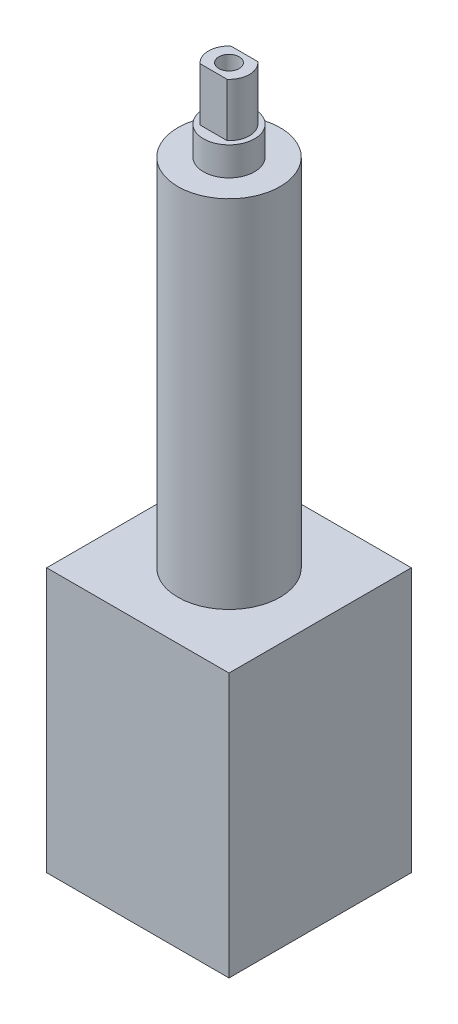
ISO-10303-21;
HEADER;
FILE_DESCRIPTION(('STEP AP214'),'2;1');
FILE_NAME('part.step','',(''),(''),'','','');
FILE_SCHEMA(('AUTOMOTIVE_DESIGN { 1 0 10303 214 1 1 1 1 }'));
ENDSEC;
DATA;
#1=APPLICATION_CONTEXT('core data for automotive mechanical design processes');
#2=APPLICATION_PROTOCOL_DEFINITION('international standard','automotive_design',2000,#1);
#3=PRODUCT_CONTEXT('',#1,'mechanical');
#4=PRODUCT('Part','Part','',(#3));
#5=PRODUCT_RELATED_PRODUCT_CATEGORY('part','',(#4));
#6=PRODUCT_DEFINITION_FORMATION('','',#4);
#7=PRODUCT_DEFINITION_CONTEXT('part definition',#1,'design');
#8=PRODUCT_DEFINITION('design','',#6,#7);
#9=PRODUCT_DEFINITION_SHAPE('','',#8);
#10=(LENGTH_UNIT() NAMED_UNIT(*) SI_UNIT(.MILLI.,.METRE.));
#11=(NAMED_UNIT(*) PLANE_ANGLE_UNIT() SI_UNIT($,.RADIAN.));
#12=(NAMED_UNIT(*) SI_UNIT($,.STERADIAN.) SOLID_ANGLE_UNIT());
#13=UNCERTAINTY_MEASURE_WITH_UNIT(LENGTH_MEASURE(1.E-05),#10,'distance_accuracy_value','');
#14=(GEOMETRIC_REPRESENTATION_CONTEXT(3) GLOBAL_UNCERTAINTY_ASSIGNED_CONTEXT((#13)) GLOBAL_UNIT_ASSIGNED_CONTEXT((#10,
#11,#12)) REPRESENTATION_CONTEXT('',''));
#15=CARTESIAN_POINT('',(0.,0.,0.));
#16=DIRECTION('',(0.,0.,1.));
#17=DIRECTION('',(1.,0.,0.));
#18=AXIS2_PLACEMENT_3D('',#15,#16,#17);
#19=CARTESIAN_POINT('',(0.,217.932,0.));
#20=DIRECTION('',(0.,-1.,0.));
#21=DIRECTION('',(0.,0.,-1.));
#22=AXIS2_PLACEMENT_3D('',#19,#20,#21);
#23=CYLINDRICAL_SURFACE('',#22,6.35);
#24=DIRECTION('',(0.,-1.,0.));
#25=VECTOR('',#24,1.);
#26=CARTESIAN_POINT('',(4.20013020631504,217.932,-4.7625));
#27=LINE('',#26,#25);
#28=CARTESIAN_POINT('',(4.20013020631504,217.932,-4.7625));
#29=VERTEX_POINT('',#28);
#30=CARTESIAN_POINT('',(4.20013020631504,201.422,-4.7625));
#31=VERTEX_POINT('',#30);
#32=EDGE_CURVE('E172',#29,#31,#27,.T.);
#33=ORIENTED_EDGE('',*,*,#32,.F.);
#34=CARTESIAN_POINT('',(0.,217.932,0.));
#35=DIRECTION('',(0.,1.,0.));
#36=DIRECTION('',(0.,0.,1.));
#37=AXIS2_PLACEMENT_3D('',#34,#35,#36);
#38=CIRCLE('',#37,6.35);
#39=CARTESIAN_POINT('',(4.20013020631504,217.932,4.7625));
#40=VERTEX_POINT('',#39);
#41=EDGE_CURVE('E111',#40,#29,#38,.T.);
#42=ORIENTED_EDGE('',*,*,#41,.F.);
#43=DIRECTION('',(0.,-1.,0.));
#44=VECTOR('',#43,1.);
#45=CARTESIAN_POINT('',(4.20013020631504,217.932,4.7625));
#46=LINE('',#45,#44);
#47=CARTESIAN_POINT('',(4.20013020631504,201.422,4.7625));
#48=VERTEX_POINT('',#47);
#49=EDGE_CURVE('E52',#48,#40,#46,.F.);
#50=ORIENTED_EDGE('',*,*,#49,.F.);
#51=CARTESIAN_POINT('',(0.,201.422,0.));
#52=DIRECTION('',(0.,1.,0.));
#53=DIRECTION('',(0.,0.,1.));
#54=AXIS2_PLACEMENT_3D('',#51,#52,#53);
#55=CIRCLE('',#54,6.35);
#56=EDGE_CURVE('E109',#48,#31,#55,.T.);
#57=ORIENTED_EDGE('',*,*,#56,.T.);
#58=EDGE_LOOP('',(#33,#42,#50,#57));
#59=FACE_BOUND('',#58,.T.);
#60=ADVANCED_FACE('F30',(#59),#23,.T.);
#61=DIRECTION('',(0.,-1.,0.));
#62=VECTOR('',#61,1.);
#63=CARTESIAN_POINT('',(-4.20013020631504,217.932,-4.7625));
#64=LINE('',#63,#62);
#65=CARTESIAN_POINT('',(-4.20013020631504,201.422,-4.7625));
#66=VERTEX_POINT('',#65);
#67=CARTESIAN_POINT('',(-4.20013020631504,217.932,-4.7625));
#68=VERTEX_POINT('',#67);
#69=EDGE_CURVE('E45',#66,#68,#64,.F.);
#70=ORIENTED_EDGE('',*,*,#69,.F.);
#71=CARTESIAN_POINT('',(-4.20013020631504,201.422,4.7625));
#72=VERTEX_POINT('',#71);
#73=EDGE_CURVE('E117',#66,#72,#55,.T.);
#74=ORIENTED_EDGE('',*,*,#73,.T.);
#75=DIRECTION('',(0.,-1.,0.));
#76=VECTOR('',#75,1.);
#77=CARTESIAN_POINT('',(-4.20013020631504,217.932,4.7625));
#78=LINE('',#77,#76);
#79=CARTESIAN_POINT('',(-4.20013020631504,217.932,4.7625));
#80=VERTEX_POINT('',#79);
#81=EDGE_CURVE('E98',#80,#72,#78,.T.);
#82=ORIENTED_EDGE('',*,*,#81,.F.);
#83=EDGE_CURVE('E116',#68,#80,#38,.T.);
#84=ORIENTED_EDGE('',*,*,#83,.F.);
#85=EDGE_LOOP('',(#70,#74,#82,#84));
#86=FACE_BOUND('',#85,.T.);
#87=ADVANCED_FACE('F170',(#86),#23,.T.);
#88=CARTESIAN_POINT('',(0.,217.932,0.));
#89=DIRECTION('',(0.,1.,0.));
#90=DIRECTION('',(0.,0.,1.));
#91=AXIS2_PLACEMENT_3D('',#88,#89,#90);
#92=PLANE('',#91);
#93=CARTESIAN_POINT('',(0.,217.932,0.));
#94=DIRECTION('',(0.,1.,0.));
#95=DIRECTION('',(0.,0.,1.));
#96=AXIS2_PLACEMENT_3D('',#93,#94,#95);
#97=CIRCLE('',#96,3.175);
#98=CARTESIAN_POINT('',(0.,217.932,3.175));
#99=VERTEX_POINT('',#98);
#100=EDGE_CURVE('E121',#99,#99,#97,.T.);
#101=ORIENTED_EDGE('',*,*,#100,.F.);
#102=EDGE_LOOP('',(#101));
#103=FACE_BOUND('',#102,.T.);
#104=ORIENTED_EDGE('',*,*,#41,.T.);
#105=DIRECTION('',(-1.,0.,0.));
#106=VECTOR('',#105,1.);
#107=CARTESIAN_POINT('',(0.,217.932,-4.7625));
#108=LINE('',#107,#106);
#109=EDGE_CURVE('E11',#29,#68,#108,.T.);
#110=ORIENTED_EDGE('',*,*,#109,.T.);
#111=ORIENTED_EDGE('',*,*,#83,.T.);
#112=DIRECTION('',(1.,0.,0.));
#113=VECTOR('',#112,1.);
#114=CARTESIAN_POINT('',(0.,217.932,4.7625));
#115=LINE('',#114,#113);
#116=EDGE_CURVE('E38',#80,#40,#115,.T.);
#117=ORIENTED_EDGE('',*,*,#116,.T.);
#118=EDGE_LOOP('',(#104,#110,#111,#117));
#119=FACE_BOUND('',#118,.T.);
#120=ADVANCED_FACE('F167',(#103,#119),#92,.T.);
#121=CARTESIAN_POINT('',(0.,201.422,0.));
#122=DIRECTION('',(0.,1.,0.));
#123=DIRECTION('',(0.,0.,1.));
#124=AXIS2_PLACEMENT_3D('',#121,#122,#123);
#125=PLANE('',#124);
#126=DIRECTION('',(1.,0.,0.));
#127=VECTOR('',#126,1.);
#128=CARTESIAN_POINT('',(8.255,201.422,-4.7625));
#129=LINE('',#128,#127);
#130=EDGE_CURVE('E103',#66,#31,#129,.T.);
#131=ORIENTED_EDGE('',*,*,#130,.T.);
#132=ORIENTED_EDGE('',*,*,#56,.F.);
#133=DIRECTION('',(-1.,0.,0.));
#134=VECTOR('',#133,1.);
#135=CARTESIAN_POINT('',(8.255,201.422,4.7625));
#136=LINE('',#135,#134);
#137=EDGE_CURVE('E95',#48,#72,#136,.T.);
#138=ORIENTED_EDGE('',*,*,#137,.T.);
#139=ORIENTED_EDGE('',*,*,#73,.F.);
#140=EDGE_LOOP('',(#131,#132,#138,#139));
#141=FACE_BOUND('',#140,.T.);
#142=CARTESIAN_POINT('',(0.,201.422,0.));
#143=DIRECTION('',(0.,1.,0.));
#144=DIRECTION('',(0.,0.,1.));
#145=AXIS2_PLACEMENT_3D('',#142,#143,#144);
#146=CIRCLE('',#145,7.9375);
#147=CARTESIAN_POINT('',(0.,201.422,7.9375));
#148=VERTEX_POINT('',#147);
#149=EDGE_CURVE('E128',#148,#148,#146,.T.);
#150=ORIENTED_EDGE('',*,*,#149,.T.);
#151=EDGE_LOOP('',(#150));
#152=FACE_BOUND('',#151,.T.);
#153=ADVANCED_FACE('F114',(#141,#152),#125,.T.);
#154=CARTESIAN_POINT('',(0.,192.532,0.));
#155=DIRECTION('',(0.,1.,0.));
#156=DIRECTION('',(0.,0.,1.));
#157=AXIS2_PLACEMENT_3D('',#154,#155,#156);
#158=PLANE('',#157);
#159=CARTESIAN_POINT('',(0.,192.532,0.));
#160=DIRECTION('',(0.,1.,0.));
#161=DIRECTION('',(0.,0.,1.));
#162=AXIS2_PLACEMENT_3D('',#159,#160,#161);
#163=CIRCLE('',#162,15.875);
#164=CARTESIAN_POINT('',(0.,192.532,15.875));
#165=VERTEX_POINT('',#164);
#166=EDGE_CURVE('E134',#165,#165,#163,.T.);
#167=ORIENTED_EDGE('',*,*,#166,.T.);
#168=EDGE_LOOP('',(#167));
#169=FACE_BOUND('',#168,.T.);
#170=CARTESIAN_POINT('',(0.,192.532,0.));
#171=DIRECTION('',(0.,1.,0.));
#172=DIRECTION('',(0.,0.,1.));
#173=AXIS2_PLACEMENT_3D('',#170,#171,#172);
#174=CIRCLE('',#173,7.9375);
#175=CARTESIAN_POINT('',(0.,192.532,7.9375));
#176=VERTEX_POINT('',#175);
#177=EDGE_CURVE('E125',#176,#176,#174,.T.);
#178=ORIENTED_EDGE('',*,*,#177,.F.);
#179=EDGE_LOOP('',(#178));
#180=FACE_BOUND('',#179,.T.);
#181=ADVANCED_FACE('F197',(#169,#180),#158,.T.);
#182=CARTESIAN_POINT('',(-28.321,82.042,28.321));
#183=DIRECTION('',(0.,1.,0.));
#184=DIRECTION('',(0.,0.,1.));
#185=AXIS2_PLACEMENT_3D('',#182,#183,#184);
#186=PLANE('',#185);
#187=DIRECTION('',(0.,0.,1.));
#188=VECTOR('',#187,1.);
#189=CARTESIAN_POINT('',(-28.321,82.042,-28.321));
#190=LINE('',#189,#188);
#191=CARTESIAN_POINT('',(-28.321,82.042,-28.321));
#192=VERTEX_POINT('',#191);
#193=CARTESIAN_POINT('',(-28.321,82.042,28.321));
#194=VERTEX_POINT('',#193);
#195=EDGE_CURVE('E146',#192,#194,#190,.T.);
#196=ORIENTED_EDGE('',*,*,#195,.T.);
#197=DIRECTION('',(1.,0.,0.));
#198=VECTOR('',#197,1.);
#199=CARTESIAN_POINT('',(-28.321,82.042,28.321));
#200=LINE('',#199,#198);
#201=CARTESIAN_POINT('',(28.321,82.042,28.321));
#202=VERTEX_POINT('',#201);
#203=EDGE_CURVE('E149',#194,#202,#200,.T.);
#204=ORIENTED_EDGE('',*,*,#203,.T.);
#205=DIRECTION('',(0.,0.,-1.));
#206=VECTOR('',#205,1.);
#207=CARTESIAN_POINT('',(28.321,82.042,-28.321));
#208=LINE('',#207,#206);
#209=CARTESIAN_POINT('',(28.321,82.042,-28.321));
#210=VERTEX_POINT('',#209);
#211=EDGE_CURVE('E151',#202,#210,#208,.T.);
#212=ORIENTED_EDGE('',*,*,#211,.T.);
#213=DIRECTION('',(-1.,0.,0.));
#214=VECTOR('',#213,1.);
#215=CARTESIAN_POINT('',(-28.321,82.042,-28.321));
#216=LINE('',#215,#214);
#217=EDGE_CURVE('E153',#210,#192,#216,.T.);
#218=ORIENTED_EDGE('',*,*,#217,.T.);
#219=EDGE_LOOP('',(#196,#204,#212,#218));
#220=FACE_BOUND('',#219,.T.);
#221=CARTESIAN_POINT('',(0.,82.042,0.));
#222=DIRECTION('',(0.,1.,0.));
#223=DIRECTION('',(0.,0.,1.));
#224=AXIS2_PLACEMENT_3D('',#221,#222,#223);
#225=CIRCLE('',#224,15.875);
#226=CARTESIAN_POINT('',(0.,82.042,15.875));
#227=VERTEX_POINT('',#226);
#228=EDGE_CURVE('E131',#227,#227,#225,.T.);
#229=ORIENTED_EDGE('',*,*,#228,.F.);
#230=EDGE_LOOP('',(#229));
#231=FACE_BOUND('',#230,.T.);
#232=ADVANCED_FACE('F212',(#220,#231),#186,.T.);
#233=CARTESIAN_POINT('',(-28.321,82.042,-28.321));
#234=DIRECTION('',(1.,0.,0.));
#235=DIRECTION('',(0.,0.,-1.));
#236=AXIS2_PLACEMENT_3D('',#233,#234,#235);
#237=PLANE('',#236);
#238=DIRECTION('',(0.,0.,1.));
#239=VECTOR('',#238,1.);
#240=CARTESIAN_POINT('',(-28.321,0.,-28.321));
#241=LINE('',#240,#239);
#242=CARTESIAN_POINT('',(-28.321,0.,-28.321));
#243=VERTEX_POINT('',#242);
#244=CARTESIAN_POINT('',(-28.321,0.,28.321));
#245=VERTEX_POINT('',#244);
#246=EDGE_CURVE('E137',#243,#245,#241,.T.);
#247=ORIENTED_EDGE('',*,*,#246,.T.);
#248=DIRECTION('',(0.,-1.,0.));
#249=VECTOR('',#248,1.);
#250=CARTESIAN_POINT('',(-28.321,82.042,28.321));
#251=LINE('',#250,#249);
#252=EDGE_CURVE('E164',#194,#245,#251,.T.);
#253=ORIENTED_EDGE('',*,*,#252,.F.);
#254=ORIENTED_EDGE('',*,*,#195,.F.);
#255=DIRECTION('',(0.,-1.,0.));
#256=VECTOR('',#255,1.);
#257=CARTESIAN_POINT('',(-28.321,82.042,-28.321));
#258=LINE('',#257,#256);
#259=EDGE_CURVE('E155',#192,#243,#258,.T.);
#260=ORIENTED_EDGE('',*,*,#259,.T.);
#261=EDGE_LOOP('',(#247,#253,#254,#260));
#262=FACE_BOUND('',#261,.T.);
#263=ADVANCED_FACE('F32',(#262),#237,.F.);
#264=CARTESIAN_POINT('',(-28.321,82.042,28.321));
#265=DIRECTION('',(0.,0.,-1.));
#266=DIRECTION('',(-1.,0.,0.));
#267=AXIS2_PLACEMENT_3D('',#264,#265,#266);
#268=PLANE('',#267);
#269=DIRECTION('',(1.,0.,0.));
#270=VECTOR('',#269,1.);
#271=CARTESIAN_POINT('',(-28.321,0.,28.321));
#272=LINE('',#271,#270);
#273=CARTESIAN_POINT('',(28.321,0.,28.321));
#274=VERTEX_POINT('',#273);
#275=EDGE_CURVE('E140',#245,#274,#272,.T.);
#276=ORIENTED_EDGE('',*,*,#275,.T.);
#277=DIRECTION('',(0.,-1.,0.));
#278=VECTOR('',#277,1.);
#279=CARTESIAN_POINT('',(28.321,82.042,28.321));
#280=LINE('',#279,#278);
#281=EDGE_CURVE('E161',#202,#274,#280,.T.);
#282=ORIENTED_EDGE('',*,*,#281,.F.);
#283=ORIENTED_EDGE('',*,*,#203,.F.);
#284=ORIENTED_EDGE('',*,*,#252,.T.);
#285=EDGE_LOOP('',(#276,#282,#283,#284));
#286=FACE_BOUND('',#285,.T.);
#287=ADVANCED_FACE('F230',(#286),#268,.F.);
#288=CARTESIAN_POINT('',(28.321,82.042,-28.321));
#289=DIRECTION('',(-1.,0.,0.));
#290=DIRECTION('',(0.,0.,1.));
#291=AXIS2_PLACEMENT_3D('',#288,#289,#290);
#292=PLANE('',#291);
#293=DIRECTION('',(0.,0.,-1.));
#294=VECTOR('',#293,1.);
#295=CARTESIAN_POINT('',(28.321,0.,-28.321));
#296=LINE('',#295,#294);
#297=CARTESIAN_POINT('',(28.321,0.,-28.321));
#298=VERTEX_POINT('',#297);
#299=EDGE_CURVE('E142',#274,#298,#296,.T.);
#300=ORIENTED_EDGE('',*,*,#299,.T.);
#301=DIRECTION('',(0.,-1.,0.));
#302=VECTOR('',#301,1.);
#303=CARTESIAN_POINT('',(28.321,82.042,-28.321));
#304=LINE('',#303,#302);
#305=EDGE_CURVE('E158',#210,#298,#304,.T.);
#306=ORIENTED_EDGE('',*,*,#305,.F.);
#307=ORIENTED_EDGE('',*,*,#211,.F.);
#308=ORIENTED_EDGE('',*,*,#281,.T.);
#309=EDGE_LOOP('',(#300,#306,#307,#308));
#310=FACE_BOUND('',#309,.T.);
#311=ADVANCED_FACE('F227',(#310),#292,.F.);
#312=CARTESIAN_POINT('',(-28.321,82.042,-28.321));
#313=DIRECTION('',(0.,0.,1.));
#314=DIRECTION('',(1.,0.,0.));
#315=AXIS2_PLACEMENT_3D('',#312,#313,#314);
#316=PLANE('',#315);
#317=DIRECTION('',(-1.,0.,0.));
#318=VECTOR('',#317,1.);
#319=CARTESIAN_POINT('',(-28.321,0.,-28.321));
#320=LINE('',#319,#318);
#321=EDGE_CURVE('E144',#298,#243,#320,.T.);
#322=ORIENTED_EDGE('',*,*,#321,.T.);
#323=ORIENTED_EDGE('',*,*,#259,.F.);
#324=ORIENTED_EDGE('',*,*,#217,.F.);
#325=ORIENTED_EDGE('',*,*,#305,.T.);
#326=EDGE_LOOP('',(#322,#323,#324,#325));
#327=FACE_BOUND('',#326,.T.);
#328=ADVANCED_FACE('F220',(#327),#316,.F.);
#329=CARTESIAN_POINT('',(-28.321,0.,28.321));
#330=DIRECTION('',(0.,1.,0.));
#331=DIRECTION('',(0.,0.,1.));
#332=AXIS2_PLACEMENT_3D('',#329,#330,#331);
#333=PLANE('',#332);
#334=ORIENTED_EDGE('',*,*,#246,.F.);
#335=ORIENTED_EDGE('',*,*,#321,.F.);
#336=ORIENTED_EDGE('',*,*,#299,.F.);
#337=ORIENTED_EDGE('',*,*,#275,.F.);
#338=EDGE_LOOP('',(#334,#335,#336,#337));
#339=FACE_BOUND('',#338,.T.);
#340=ADVANCED_FACE('F216',(#339),#333,.F.);
#341=CARTESIAN_POINT('',(0.,192.532,0.));
#342=DIRECTION('',(0.,-1.,0.));
#343=DIRECTION('',(0.,0.,-1.));
#344=AXIS2_PLACEMENT_3D('',#341,#342,#343);
#345=CYLINDRICAL_SURFACE('',#344,15.875);
#346=ORIENTED_EDGE('',*,*,#166,.F.);
#347=EDGE_LOOP('',(#346));
#348=FACE_BOUND('',#347,.T.);
#349=ORIENTED_EDGE('',*,*,#228,.T.);
#350=EDGE_LOOP('',(#349));
#351=FACE_BOUND('',#350,.T.);
#352=ADVANCED_FACE('F208',(#348,#351),#345,.T.);
#353=CARTESIAN_POINT('',(0.,201.422,0.));
#354=DIRECTION('',(0.,-1.,0.));
#355=DIRECTION('',(0.,0.,-1.));
#356=AXIS2_PLACEMENT_3D('',#353,#354,#355);
#357=CYLINDRICAL_SURFACE('',#356,7.9375);
#358=ORIENTED_EDGE('',*,*,#149,.F.);
#359=EDGE_LOOP('',(#358));
#360=FACE_BOUND('',#359,.T.);
#361=ORIENTED_EDGE('',*,*,#177,.T.);
#362=EDGE_LOOP('',(#361));
#363=FACE_BOUND('',#362,.T.);
#364=ADVANCED_FACE('F205',(#360,#363),#357,.T.);
#365=CARTESIAN_POINT('',(0.,217.932,0.));
#366=DIRECTION('',(0.,1.,0.));
#367=DIRECTION('',(0.,0.,1.));
#368=AXIS2_PLACEMENT_3D('',#365,#366,#367);
#369=CYLINDRICAL_SURFACE('',#368,3.175);
#370=CARTESIAN_POINT('',(0.,208.28,0.));
#371=DIRECTION('',(0.,1.,0.));
#372=DIRECTION('',(0.,0.,1.));
#373=AXIS2_PLACEMENT_3D('',#370,#371,#372);
#374=CIRCLE('',#373,3.175);
#375=CARTESIAN_POINT('',(0.,208.28,3.175));
#376=VERTEX_POINT('',#375);
#377=EDGE_CURVE('E182',#376,#376,#374,.T.);
#378=ORIENTED_EDGE('',*,*,#377,.F.);
#379=EDGE_LOOP('',(#378));
#380=FACE_BOUND('',#379,.T.);
#381=ORIENTED_EDGE('',*,*,#100,.T.);
#382=EDGE_LOOP('',(#381));
#383=FACE_BOUND('',#382,.T.);
#384=ADVANCED_FACE('F189',(#380,#383),#369,.F.);
#385=CARTESIAN_POINT('',(2.7051,208.28,0.));
#386=DIRECTION('',(0.,-1.,0.));
#387=DIRECTION('',(0.,0.,-1.));
#388=AXIS2_PLACEMENT_3D('',#385,#386,#387);
#389=PLANE('',#388);
#390=CARTESIAN_POINT('',(0.,208.28,0.));
#391=DIRECTION('',(0.,1.,0.));
#392=DIRECTION('',(0.,0.,1.));
#393=AXIS2_PLACEMENT_3D('',#390,#391,#392);
#394=CIRCLE('',#393,2.7051);
#395=CARTESIAN_POINT('',(0.,208.28,2.7051));
#396=VERTEX_POINT('',#395);
#397=EDGE_CURVE('E180',#396,#396,#394,.T.);
#398=ORIENTED_EDGE('',*,*,#397,.F.);
#399=EDGE_LOOP('',(#398));
#400=FACE_BOUND('',#399,.T.);
#401=ORIENTED_EDGE('',*,*,#377,.T.);
#402=EDGE_LOOP('',(#401));
#403=FACE_BOUND('',#402,.T.);
#404=ADVANCED_FACE('F309',(#400,#403),#389,.F.);
#405=CARTESIAN_POINT('',(0.,217.932,0.));
#406=DIRECTION('',(0.,1.,0.));
#407=DIRECTION('',(0.,0.,1.));
#408=AXIS2_PLACEMENT_3D('',#405,#406,#407);
#409=CYLINDRICAL_SURFACE('',#408,2.7051);
#410=CARTESIAN_POINT('',(0.,205.74,0.));
#411=DIRECTION('',(0.,1.,0.));
#412=DIRECTION('',(0.,0.,1.));
#413=AXIS2_PLACEMENT_3D('',#410,#411,#412);
#414=CIRCLE('',#413,2.7051);
#415=CARTESIAN_POINT('',(0.,205.74,2.7051));
#416=VERTEX_POINT('',#415);
#417=EDGE_CURVE('E177',#416,#416,#414,.T.);
#418=ORIENTED_EDGE('',*,*,#417,.F.);
#419=EDGE_LOOP('',(#418));
#420=FACE_BOUND('',#419,.T.);
#421=ORIENTED_EDGE('',*,*,#397,.T.);
#422=EDGE_LOOP('',(#421));
#423=FACE_BOUND('',#422,.T.);
#424=ADVANCED_FACE('F305',(#420,#423),#409,.F.);
#425=CARTESIAN_POINT('',(0.,205.74,0.));
#426=DIRECTION('',(0.,1.,0.));
#427=DIRECTION('',(0.,0.,1.));
#428=AXIS2_PLACEMENT_3D('',#425,#426,#427);
#429=CONICAL_SURFACE('',#428,2.7051,1.02974425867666);
#430=CARTESIAN_POINT('',(0.,204.114611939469,0.));
#431=VERTEX_POINT('',#430);
#432=VERTEX_LOOP('',#431);
#433=FACE_BOUND('',#432,.T.);
#434=ORIENTED_EDGE('',*,*,#417,.T.);
#435=EDGE_LOOP('',(#434));
#436=FACE_BOUND('',#435,.T.);
#437=ADVANCED_FACE('F290',(#433,#436),#429,.F.);
#438=CARTESIAN_POINT('',(8.255,168.274026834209,4.7625));
#439=DIRECTION('',(0.,0.,1.));
#440=DIRECTION('',(1.,0.,0.));
#441=AXIS2_PLACEMENT_3D('',#438,#439,#440);
#442=PLANE('',#441);
#443=ORIENTED_EDGE('',*,*,#81,.T.);
#444=ORIENTED_EDGE('',*,*,#137,.F.);
#445=ORIENTED_EDGE('',*,*,#49,.T.);
#446=ORIENTED_EDGE('',*,*,#116,.F.);
#447=EDGE_LOOP('',(#443,#444,#445,#446));
#448=FACE_BOUND('',#447,.T.);
#449=ADVANCED_FACE('F96',(#448),#442,.T.);
#450=CARTESIAN_POINT('',(8.255,168.274026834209,-4.7625));
#451=DIRECTION('',(0.,0.,-1.));
#452=DIRECTION('',(-1.,0.,0.));
#453=AXIS2_PLACEMENT_3D('',#450,#451,#452);
#454=PLANE('',#453);
#455=ORIENTED_EDGE('',*,*,#32,.T.);
#456=ORIENTED_EDGE('',*,*,#130,.F.);
#457=ORIENTED_EDGE('',*,*,#69,.T.);
#458=ORIENTED_EDGE('',*,*,#109,.F.);
#459=EDGE_LOOP('',(#455,#456,#457,#458));
#460=FACE_BOUND('',#459,.T.);
#461=ADVANCED_FACE('F289',(#460),#454,.T.);
#462=CLOSED_SHELL('',(#60,#87,#120,#153,#181,#232,#263,#287,#311,#328,#340,#352,#364,#384,#404,
#424,#437,#449,#461));
#463=MANIFOLD_SOLID_BREP('B2',#462);
#464=ADVANCED_BREP_SHAPE_REPRESENTATION('',(#18,#463),#14);
#465=SHAPE_DEFINITION_REPRESENTATION(#9,#464);
ENDSEC;
END-ISO-10303-21;
